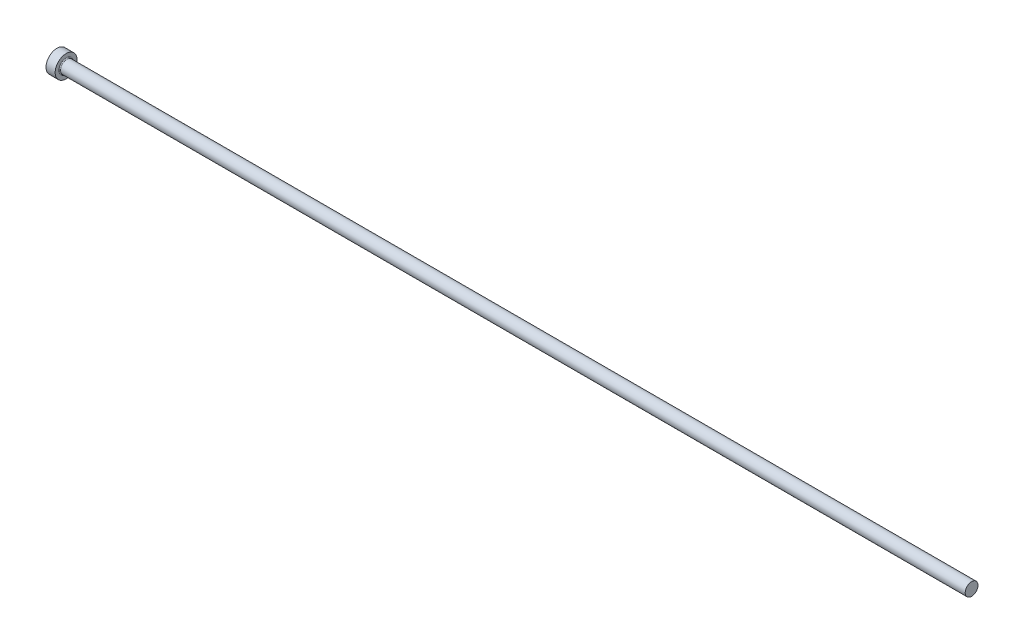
ISO-10303-21;
HEADER;
FILE_DESCRIPTION(('STEP AP214'),'2;1');
FILE_NAME('part.step','',(''),(''),'','','');
FILE_SCHEMA(('AUTOMOTIVE_DESIGN { 1 0 10303 214 1 1 1 1 }'));
ENDSEC;
DATA;
#1=APPLICATION_CONTEXT('core data for automotive mechanical design processes');
#2=APPLICATION_PROTOCOL_DEFINITION('international standard','automotive_design',2000,#1);
#3=PRODUCT_CONTEXT('',#1,'mechanical');
#4=PRODUCT('Part','Part','',(#3));
#5=PRODUCT_RELATED_PRODUCT_CATEGORY('part','',(#4));
#6=PRODUCT_DEFINITION_FORMATION('','',#4);
#7=PRODUCT_DEFINITION_CONTEXT('part definition',#1,'design');
#8=PRODUCT_DEFINITION('design','',#6,#7);
#9=PRODUCT_DEFINITION_SHAPE('','',#8);
#10=(LENGTH_UNIT() NAMED_UNIT(*) SI_UNIT(.MILLI.,.METRE.));
#11=(NAMED_UNIT(*) PLANE_ANGLE_UNIT() SI_UNIT($,.RADIAN.));
#12=(NAMED_UNIT(*) SI_UNIT($,.STERADIAN.) SOLID_ANGLE_UNIT());
#13=UNCERTAINTY_MEASURE_WITH_UNIT(LENGTH_MEASURE(1.E-05),#10,'distance_accuracy_value','');
#14=(GEOMETRIC_REPRESENTATION_CONTEXT(3) GLOBAL_UNCERTAINTY_ASSIGNED_CONTEXT((#13)) GLOBAL_UNIT_ASSIGNED_CONTEXT((#10,
#11,#12)) REPRESENTATION_CONTEXT('',''));
#15=CARTESIAN_POINT('',(0.,0.,0.));
#16=DIRECTION('',(0.,0.,1.));
#17=DIRECTION('',(1.,0.,0.));
#18=AXIS2_PLACEMENT_3D('',#15,#16,#17);
#19=CARTESIAN_POINT('',(0.,0.,0.));
#20=DIRECTION('',(-1.,0.,0.));
#21=DIRECTION('',(0.,-1.,0.));
#22=AXIS2_PLACEMENT_3D('',#19,#20,#21);
#23=PLANE('',#22);
#24=CARTESIAN_POINT('',(0.,0.,0.));
#25=DIRECTION('',(1.,0.,0.));
#26=DIRECTION('',(0.,1.,0.));
#27=AXIS2_PLACEMENT_3D('',#24,#25,#26);
#28=CIRCLE('',#27,6.);
#29=CARTESIAN_POINT('',(0.,6.,0.));
#30=VERTEX_POINT('',#29);
#31=EDGE_CURVE('E25',#30,#30,#28,.T.);
#32=ORIENTED_EDGE('',*,*,#31,.F.);
#33=EDGE_LOOP('',(#32));
#34=FACE_BOUND('',#33,.T.);
#35=ADVANCED_FACE('F14',(#34),#23,.T.);
#36=CARTESIAN_POINT('',(500.,0.,0.));
#37=DIRECTION('',(1.,0.,0.));
#38=DIRECTION('',(0.,1.,0.));
#39=AXIS2_PLACEMENT_3D('',#36,#37,#38);
#40=CYLINDRICAL_SURFACE('',#39,6.);
#41=ORIENTED_EDGE('',*,*,#31,.T.);
#42=EDGE_LOOP('',(#41));
#43=FACE_BOUND('',#42,.T.);
#44=CARTESIAN_POINT('',(5.,0.,0.));
#45=DIRECTION('',(1.,0.,0.));
#46=DIRECTION('',(0.,1.,0.));
#47=AXIS2_PLACEMENT_3D('',#44,#45,#46);
#48=CIRCLE('',#47,6.);
#49=CARTESIAN_POINT('',(5.,6.,0.));
#50=VERTEX_POINT('',#49);
#51=EDGE_CURVE('E29',#50,#50,#48,.T.);
#52=ORIENTED_EDGE('',*,*,#51,.F.);
#53=EDGE_LOOP('',(#52));
#54=FACE_BOUND('',#53,.T.);
#55=ADVANCED_FACE('F51',(#43,#54),#40,.T.);
#56=CARTESIAN_POINT('',(5.,6.,0.));
#57=DIRECTION('',(1.,0.,0.));
#58=DIRECTION('',(0.,1.,0.));
#59=AXIS2_PLACEMENT_3D('',#56,#57,#58);
#60=PLANE('',#59);
#61=CARTESIAN_POINT('',(5.,0.,0.));
#62=DIRECTION('',(1.,0.,0.));
#63=DIRECTION('',(0.,1.,0.));
#64=AXIS2_PLACEMENT_3D('',#61,#62,#63);
#65=CIRCLE('',#64,3.99999999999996);
#66=CARTESIAN_POINT('',(5.,3.99999999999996,0.));
#67=VERTEX_POINT('',#66);
#68=EDGE_CURVE('E9',#67,#67,#65,.F.);
#69=ORIENTED_EDGE('',*,*,#68,.T.);
#70=EDGE_LOOP('',(#69));
#71=FACE_BOUND('',#70,.T.);
#72=ORIENTED_EDGE('',*,*,#51,.T.);
#73=EDGE_LOOP('',(#72));
#74=FACE_BOUND('',#73,.T.);
#75=ADVANCED_FACE('F42',(#71,#74),#60,.T.);
#76=CARTESIAN_POINT('',(500.,0.,0.));
#77=DIRECTION('',(1.,0.,0.));
#78=DIRECTION('',(0.,1.,0.));
#79=AXIS2_PLACEMENT_3D('',#76,#77,#78);
#80=CYLINDRICAL_SURFACE('',#79,3.49999999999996);
#81=CARTESIAN_POINT('',(5.5,0.,0.));
#82=DIRECTION('',(1.,0.,0.));
#83=DIRECTION('',(0.,1.,0.));
#84=AXIS2_PLACEMENT_3D('',#81,#82,#83);
#85=CIRCLE('',#84,3.49999999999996);
#86=CARTESIAN_POINT('',(5.5,3.49999999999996,0.));
#87=VERTEX_POINT('',#86);
#88=EDGE_CURVE('E21',#87,#87,#85,.T.);
#89=ORIENTED_EDGE('',*,*,#88,.T.);
#90=EDGE_LOOP('',(#89));
#91=FACE_BOUND('',#90,.T.);
#92=CARTESIAN_POINT('',(500.,0.,0.));
#93=DIRECTION('',(1.,0.,0.));
#94=DIRECTION('',(0.,1.,0.));
#95=AXIS2_PLACEMENT_3D('',#92,#93,#94);
#96=CIRCLE('',#95,3.49999999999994);
#97=CARTESIAN_POINT('',(500.,3.49999999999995,0.));
#98=VERTEX_POINT('',#97);
#99=EDGE_CURVE('E34',#98,#98,#96,.T.);
#100=ORIENTED_EDGE('',*,*,#99,.F.);
#101=EDGE_LOOP('',(#100));
#102=FACE_BOUND('',#101,.T.);
#103=ADVANCED_FACE('F40',(#91,#102),#80,.T.);
#104=CARTESIAN_POINT('',(500.,3.49999999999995,0.));
#105=DIRECTION('',(1.,0.,0.));
#106=DIRECTION('',(0.,1.,0.));
#107=AXIS2_PLACEMENT_3D('',#104,#105,#106);
#108=PLANE('',#107);
#109=ORIENTED_EDGE('',*,*,#99,.T.);
#110=EDGE_LOOP('',(#109));
#111=FACE_BOUND('',#110,.T.);
#112=ADVANCED_FACE('F38',(#111),#108,.T.);
#113=CARTESIAN_POINT('',(5.5,0.,0.));
#114=DIRECTION('',(1.,0.,0.));
#115=DIRECTION('',(0.,1.,0.));
#116=AXIS2_PLACEMENT_3D('',#113,#114,#115);
#117=TOROIDAL_SURFACE('',#116,3.99999999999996,0.5);
#118=ORIENTED_EDGE('',*,*,#68,.F.);
#119=EDGE_LOOP('',(#118));
#120=FACE_BOUND('',#119,.T.);
#121=ORIENTED_EDGE('',*,*,#88,.F.);
#122=EDGE_LOOP('',(#121));
#123=FACE_BOUND('',#122,.T.);
#124=ADVANCED_FACE('F16',(#120,#123),#117,.F.);
#125=CLOSED_SHELL('',(#35,#55,#75,#103,#112,#124));
#126=MANIFOLD_SOLID_BREP('B1',#125);
#127=ADVANCED_BREP_SHAPE_REPRESENTATION('',(#18,#126),#14);
#128=SHAPE_DEFINITION_REPRESENTATION(#9,#127);
ENDSEC;
END-ISO-10303-21;
